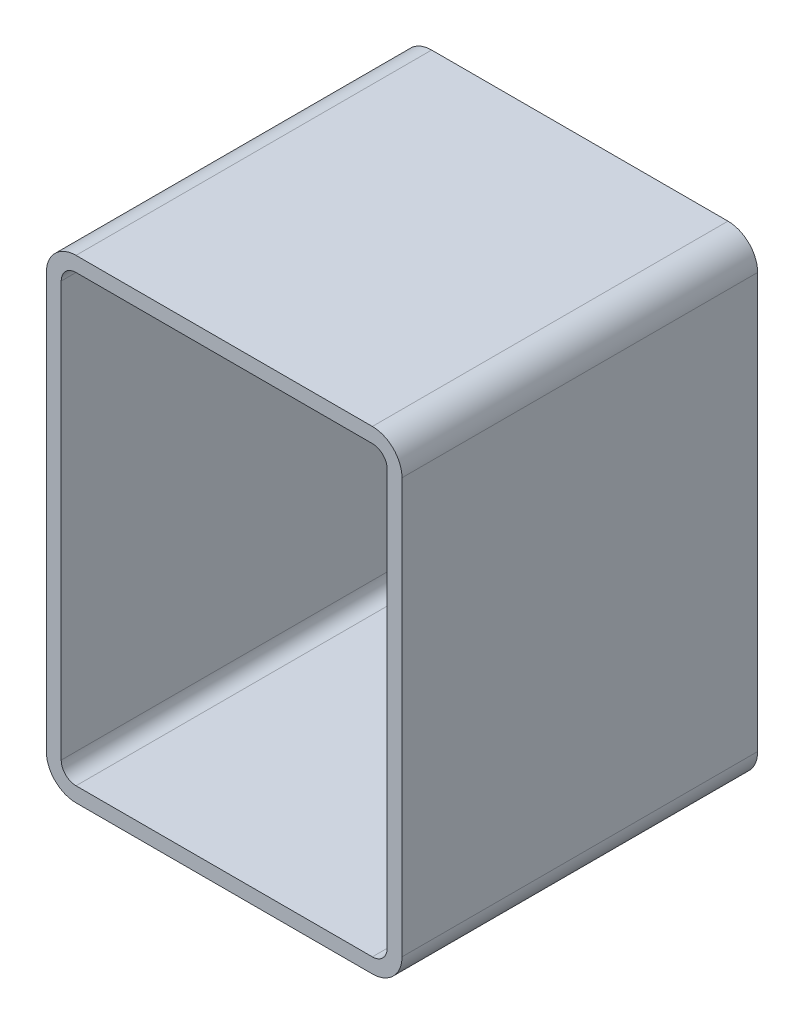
ISO-10303-21;
HEADER;
FILE_DESCRIPTION(('STEP AP214'),'2;1');
FILE_NAME('part.step','',(''),(''),'','','');
FILE_SCHEMA(('AUTOMOTIVE_DESIGN { 1 0 10303 214 1 1 1 1 }'));
ENDSEC;
DATA;
#1=APPLICATION_CONTEXT('core data for automotive mechanical design processes');
#2=APPLICATION_PROTOCOL_DEFINITION('international standard','automotive_design',2000,#1);
#3=PRODUCT_CONTEXT('',#1,'mechanical');
#4=PRODUCT('Part','Part','',(#3));
#5=PRODUCT_RELATED_PRODUCT_CATEGORY('part','',(#4));
#6=PRODUCT_DEFINITION_FORMATION('','',#4);
#7=PRODUCT_DEFINITION_CONTEXT('part definition',#1,'design');
#8=PRODUCT_DEFINITION('design','',#6,#7);
#9=PRODUCT_DEFINITION_SHAPE('','',#8);
#10=(LENGTH_UNIT() NAMED_UNIT(*) SI_UNIT(.MILLI.,.METRE.));
#11=(NAMED_UNIT(*) PLANE_ANGLE_UNIT() SI_UNIT($,.RADIAN.));
#12=(NAMED_UNIT(*) SI_UNIT($,.STERADIAN.) SOLID_ANGLE_UNIT());
#13=UNCERTAINTY_MEASURE_WITH_UNIT(LENGTH_MEASURE(1.E-05),#10,'distance_accuracy_value','');
#14=(GEOMETRIC_REPRESENTATION_CONTEXT(3) GLOBAL_UNCERTAINTY_ASSIGNED_CONTEXT((#13)) GLOBAL_UNIT_ASSIGNED_CONTEXT((#10,
#11,#12)) REPRESENTATION_CONTEXT('',''));
#15=CARTESIAN_POINT('',(0.,0.,0.));
#16=DIRECTION('',(0.,0.,1.));
#17=DIRECTION('',(1.,0.,0.));
#18=AXIS2_PLACEMENT_3D('',#15,#16,#17);
#19=CARTESIAN_POINT('',(26.5067030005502,382.782862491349,304.8));
#20=DIRECTION('',(0.,0.,1.));
#21=DIRECTION('',(1.,0.,0.));
#22=AXIS2_PLACEMENT_3D('',#19,#20,#21);
#23=PLANE('',#22);
#24=CARTESIAN_POINT('',(26.5067030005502,382.782862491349,304.8));
#25=DIRECTION('',(0.,0.,1.));
#26=DIRECTION('',(1.,0.,0.));
#27=AXIS2_PLACEMENT_3D('',#24,#25,#26);
#28=CIRCLE('',#27,25.4);
#29=CARTESIAN_POINT('',(26.5067030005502,408.182862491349,304.8));
#30=VERTEX_POINT('',#29);
#31=CARTESIAN_POINT('',(1.10670300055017,382.782862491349,304.8));
#32=VERTEX_POINT('',#31);
#33=EDGE_CURVE('E211',#30,#32,#28,.T.);
#34=ORIENTED_EDGE('',*,*,#33,.T.);
#35=DIRECTION('',(0.,-1.,0.));
#36=VECTOR('',#35,1.);
#37=CARTESIAN_POINT('',(1.10670300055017,27.1828624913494,304.8));
#38=LINE('',#37,#36);
#39=CARTESIAN_POINT('',(1.10670300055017,27.1828624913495,304.8));
#40=VERTEX_POINT('',#39);
#41=EDGE_CURVE('E214',#32,#40,#38,.T.);
#42=ORIENTED_EDGE('',*,*,#41,.T.);
#43=CARTESIAN_POINT('',(26.5067030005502,27.1828624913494,304.8));
#44=DIRECTION('',(0.,0.,1.));
#45=DIRECTION('',(1.,0.,0.));
#46=AXIS2_PLACEMENT_3D('',#43,#44,#45);
#47=CIRCLE('',#46,25.4);
#48=CARTESIAN_POINT('',(26.5067030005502,1.78286249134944,304.8));
#49=VERTEX_POINT('',#48);
#50=EDGE_CURVE('E217',#40,#49,#47,.T.);
#51=ORIENTED_EDGE('',*,*,#50,.T.);
#52=DIRECTION('',(1.,0.,0.));
#53=VECTOR('',#52,1.);
#54=CARTESIAN_POINT('',(280.50670300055,1.78286249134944,304.8));
#55=LINE('',#54,#53);
#56=CARTESIAN_POINT('',(280.50670300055,1.78286249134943,304.8));
#57=VERTEX_POINT('',#56);
#58=EDGE_CURVE('E219',#49,#57,#55,.T.);
#59=ORIENTED_EDGE('',*,*,#58,.T.);
#60=CARTESIAN_POINT('',(280.50670300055,27.1828624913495,304.8));
#61=DIRECTION('',(0.,0.,1.));
#62=DIRECTION('',(1.,0.,0.));
#63=AXIS2_PLACEMENT_3D('',#60,#61,#62);
#64=CIRCLE('',#63,25.4);
#65=CARTESIAN_POINT('',(305.90670300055,27.1828624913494,304.8));
#66=VERTEX_POINT('',#65);
#67=EDGE_CURVE('E221',#57,#66,#64,.T.);
#68=ORIENTED_EDGE('',*,*,#67,.T.);
#69=DIRECTION('',(0.,1.,0.));
#70=VECTOR('',#69,1.);
#71=CARTESIAN_POINT('',(305.90670300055,382.782862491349,304.8));
#72=LINE('',#71,#70);
#73=CARTESIAN_POINT('',(305.90670300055,382.782862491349,304.8));
#74=VERTEX_POINT('',#73);
#75=EDGE_CURVE('E223',#66,#74,#72,.T.);
#76=ORIENTED_EDGE('',*,*,#75,.T.);
#77=CARTESIAN_POINT('',(280.50670300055,382.782862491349,304.8));
#78=DIRECTION('',(0.,0.,1.));
#79=DIRECTION('',(1.,0.,0.));
#80=AXIS2_PLACEMENT_3D('',#77,#78,#79);
#81=CIRCLE('',#80,25.4);
#82=CARTESIAN_POINT('',(280.50670300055,408.182862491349,304.8));
#83=VERTEX_POINT('',#82);
#84=EDGE_CURVE('E225',#74,#83,#81,.T.);
#85=ORIENTED_EDGE('',*,*,#84,.T.);
#86=DIRECTION('',(-1.,0.,0.));
#87=VECTOR('',#86,1.);
#88=CARTESIAN_POINT('',(26.5067030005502,408.182862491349,304.8));
#89=LINE('',#88,#87);
#90=EDGE_CURVE('E227',#83,#30,#89,.T.);
#91=ORIENTED_EDGE('',*,*,#90,.T.);
#92=EDGE_LOOP('',(#34,#42,#51,#59,#68,#76,#85,#91));
#93=FACE_BOUND('',#92,.T.);
#94=DIRECTION('',(0.,-1.,0.));
#95=VECTOR('',#94,1.);
#96=CARTESIAN_POINT('',(13.8067030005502,27.1828624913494,304.8));
#97=LINE('',#96,#95);
#98=CARTESIAN_POINT('',(13.8067030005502,382.782862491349,304.8));
#99=VERTEX_POINT('',#98);
#100=CARTESIAN_POINT('',(13.8067030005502,27.1828624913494,304.8));
#101=VERTEX_POINT('',#100);
#102=EDGE_CURVE('E154',#99,#101,#97,.T.);
#103=ORIENTED_EDGE('',*,*,#102,.F.);
#104=CARTESIAN_POINT('',(26.5067030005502,382.782862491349,304.8));
#105=DIRECTION('',(0.,0.,1.));
#106=DIRECTION('',(1.,0.,0.));
#107=AXIS2_PLACEMENT_3D('',#104,#105,#106);
#108=CIRCLE('',#107,12.7);
#109=CARTESIAN_POINT('',(26.5067030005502,395.482862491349,304.8));
#110=VERTEX_POINT('',#109);
#111=EDGE_CURVE('E146',#110,#99,#108,.T.);
#112=ORIENTED_EDGE('',*,*,#111,.F.);
#113=DIRECTION('',(-1.,0.,0.));
#114=VECTOR('',#113,1.);
#115=CARTESIAN_POINT('',(26.5067030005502,395.482862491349,304.8));
#116=LINE('',#115,#114);
#117=CARTESIAN_POINT('',(280.50670300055,395.482862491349,304.8));
#118=VERTEX_POINT('',#117);
#119=EDGE_CURVE('E179',#118,#110,#116,.T.);
#120=ORIENTED_EDGE('',*,*,#119,.F.);
#121=CARTESIAN_POINT('',(280.50670300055,382.782862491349,304.8));
#122=DIRECTION('',(0.,0.,1.));
#123=DIRECTION('',(1.,0.,0.));
#124=AXIS2_PLACEMENT_3D('',#121,#122,#123);
#125=CIRCLE('',#124,12.7);
#126=CARTESIAN_POINT('',(293.20670300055,382.782862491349,304.8));
#127=VERTEX_POINT('',#126);
#128=EDGE_CURVE('E177',#127,#118,#125,.T.);
#129=ORIENTED_EDGE('',*,*,#128,.F.);
#130=DIRECTION('',(0.,1.,0.));
#131=VECTOR('',#130,1.);
#132=CARTESIAN_POINT('',(293.20670300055,382.782862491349,304.8));
#133=LINE('',#132,#131);
#134=CARTESIAN_POINT('',(293.20670300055,27.1828624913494,304.8));
#135=VERTEX_POINT('',#134);
#136=EDGE_CURVE('E175',#135,#127,#133,.T.);
#137=ORIENTED_EDGE('',*,*,#136,.F.);
#138=CARTESIAN_POINT('',(280.50670300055,27.1828624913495,304.8));
#139=DIRECTION('',(0.,0.,1.));
#140=DIRECTION('',(1.,0.,0.));
#141=AXIS2_PLACEMENT_3D('',#138,#139,#140);
#142=CIRCLE('',#141,12.7);
#143=CARTESIAN_POINT('',(280.50670300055,14.4828624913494,304.8));
#144=VERTEX_POINT('',#143);
#145=EDGE_CURVE('E173',#144,#135,#142,.T.);
#146=ORIENTED_EDGE('',*,*,#145,.F.);
#147=DIRECTION('',(1.,0.,0.));
#148=VECTOR('',#147,1.);
#149=CARTESIAN_POINT('',(280.50670300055,14.4828624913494,304.8));
#150=LINE('',#149,#148);
#151=CARTESIAN_POINT('',(26.5067030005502,14.4828624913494,304.8));
#152=VERTEX_POINT('',#151);
#153=EDGE_CURVE('E169',#152,#144,#150,.T.);
#154=ORIENTED_EDGE('',*,*,#153,.F.);
#155=CARTESIAN_POINT('',(26.5067030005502,27.1828624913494,304.8));
#156=DIRECTION('',(0.,0.,1.));
#157=DIRECTION('',(1.,0.,0.));
#158=AXIS2_PLACEMENT_3D('',#155,#156,#157);
#159=CIRCLE('',#158,12.7);
#160=EDGE_CURVE('E167',#101,#152,#159,.T.);
#161=ORIENTED_EDGE('',*,*,#160,.F.);
#162=EDGE_LOOP('',(#103,#112,#120,#129,#137,#146,#154,#161));
#163=FACE_BOUND('',#162,.T.);
#164=ADVANCED_FACE('F33',(#93,#163),#23,.T.);
#165=CARTESIAN_POINT('',(26.5067030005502,382.782862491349,0.));
#166=DIRECTION('',(0.,0.,1.));
#167=DIRECTION('',(1.,0.,0.));
#168=AXIS2_PLACEMENT_3D('',#165,#166,#167);
#169=PLANE('',#168);
#170=CARTESIAN_POINT('',(26.5067030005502,382.782862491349,0.));
#171=DIRECTION('',(0.,0.,1.));
#172=DIRECTION('',(1.,0.,0.));
#173=AXIS2_PLACEMENT_3D('',#170,#171,#172);
#174=CIRCLE('',#173,25.4);
#175=CARTESIAN_POINT('',(26.5067030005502,408.182862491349,0.));
#176=VERTEX_POINT('',#175);
#177=CARTESIAN_POINT('',(1.10670300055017,382.782862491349,0.));
#178=VERTEX_POINT('',#177);
#179=EDGE_CURVE('E162',#176,#178,#174,.T.);
#180=ORIENTED_EDGE('',*,*,#179,.F.);
#181=DIRECTION('',(-1.,0.,0.));
#182=VECTOR('',#181,1.);
#183=CARTESIAN_POINT('',(26.5067030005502,408.182862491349,0.));
#184=LINE('',#183,#182);
#185=CARTESIAN_POINT('',(280.50670300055,408.182862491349,0.));
#186=VERTEX_POINT('',#185);
#187=EDGE_CURVE('E215',#186,#176,#184,.T.);
#188=ORIENTED_EDGE('',*,*,#187,.F.);
#189=CARTESIAN_POINT('',(280.50670300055,382.782862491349,0.));
#190=DIRECTION('',(0.,0.,1.));
#191=DIRECTION('',(1.,0.,0.));
#192=AXIS2_PLACEMENT_3D('',#189,#190,#191);
#193=CIRCLE('',#192,25.4);
#194=CARTESIAN_POINT('',(305.90670300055,382.782862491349,0.));
#195=VERTEX_POINT('',#194);
#196=EDGE_CURVE('E242',#195,#186,#193,.T.);
#197=ORIENTED_EDGE('',*,*,#196,.F.);
#198=DIRECTION('',(0.,1.,0.));
#199=VECTOR('',#198,1.);
#200=CARTESIAN_POINT('',(305.90670300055,382.782862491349,0.));
#201=LINE('',#200,#199);
#202=CARTESIAN_POINT('',(305.90670300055,27.1828624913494,0.));
#203=VERTEX_POINT('',#202);
#204=EDGE_CURVE('E240',#203,#195,#201,.T.);
#205=ORIENTED_EDGE('',*,*,#204,.F.);
#206=CARTESIAN_POINT('',(280.50670300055,27.1828624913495,0.));
#207=DIRECTION('',(0.,0.,1.));
#208=DIRECTION('',(1.,0.,0.));
#209=AXIS2_PLACEMENT_3D('',#206,#207,#208);
#210=CIRCLE('',#209,25.4);
#211=CARTESIAN_POINT('',(280.50670300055,1.78286249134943,0.));
#212=VERTEX_POINT('',#211);
#213=EDGE_CURVE('E238',#212,#203,#210,.T.);
#214=ORIENTED_EDGE('',*,*,#213,.F.);
#215=DIRECTION('',(1.,0.,0.));
#216=VECTOR('',#215,1.);
#217=CARTESIAN_POINT('',(280.50670300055,1.78286249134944,0.));
#218=LINE('',#217,#216);
#219=CARTESIAN_POINT('',(26.5067030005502,1.78286249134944,0.));
#220=VERTEX_POINT('',#219);
#221=EDGE_CURVE('E236',#220,#212,#218,.T.);
#222=ORIENTED_EDGE('',*,*,#221,.F.);
#223=CARTESIAN_POINT('',(26.5067030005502,27.1828624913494,0.));
#224=DIRECTION('',(0.,0.,1.));
#225=DIRECTION('',(1.,0.,0.));
#226=AXIS2_PLACEMENT_3D('',#223,#224,#225);
#227=CIRCLE('',#226,25.4);
#228=CARTESIAN_POINT('',(1.10670300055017,27.1828624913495,0.));
#229=VERTEX_POINT('',#228);
#230=EDGE_CURVE('E234',#229,#220,#227,.T.);
#231=ORIENTED_EDGE('',*,*,#230,.F.);
#232=DIRECTION('',(0.,-1.,0.));
#233=VECTOR('',#232,1.);
#234=CARTESIAN_POINT('',(1.10670300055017,27.1828624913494,0.));
#235=LINE('',#234,#233);
#236=EDGE_CURVE('E232',#178,#229,#235,.T.);
#237=ORIENTED_EDGE('',*,*,#236,.F.);
#238=EDGE_LOOP('',(#180,#188,#197,#205,#214,#222,#231,#237));
#239=FACE_BOUND('',#238,.T.);
#240=CARTESIAN_POINT('',(26.5067030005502,382.782862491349,0.));
#241=DIRECTION('',(0.,0.,1.));
#242=DIRECTION('',(1.,0.,0.));
#243=AXIS2_PLACEMENT_3D('',#240,#241,#242);
#244=CIRCLE('',#243,12.7);
#245=CARTESIAN_POINT('',(26.5067030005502,395.482862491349,0.));
#246=VERTEX_POINT('',#245);
#247=CARTESIAN_POINT('',(13.8067030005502,382.782862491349,0.));
#248=VERTEX_POINT('',#247);
#249=EDGE_CURVE('E56',#246,#248,#244,.T.);
#250=ORIENTED_EDGE('',*,*,#249,.T.);
#251=DIRECTION('',(0.,-1.,0.));
#252=VECTOR('',#251,1.);
#253=CARTESIAN_POINT('',(13.8067030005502,27.1828624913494,0.));
#254=LINE('',#253,#252);
#255=CARTESIAN_POINT('',(13.8067030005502,27.1828624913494,0.));
#256=VERTEX_POINT('',#255);
#257=EDGE_CURVE('E161',#248,#256,#254,.T.);
#258=ORIENTED_EDGE('',*,*,#257,.T.);
#259=CARTESIAN_POINT('',(26.5067030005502,27.1828624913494,0.));
#260=DIRECTION('',(0.,0.,1.));
#261=DIRECTION('',(1.,0.,0.));
#262=AXIS2_PLACEMENT_3D('',#259,#260,#261);
#263=CIRCLE('',#262,12.7);
#264=CARTESIAN_POINT('',(26.5067030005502,14.4828624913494,0.));
#265=VERTEX_POINT('',#264);
#266=EDGE_CURVE('E183',#256,#265,#263,.T.);
#267=ORIENTED_EDGE('',*,*,#266,.T.);
#268=DIRECTION('',(1.,0.,0.));
#269=VECTOR('',#268,1.);
#270=CARTESIAN_POINT('',(280.50670300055,14.4828624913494,0.));
#271=LINE('',#270,#269);
#272=CARTESIAN_POINT('',(280.50670300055,14.4828624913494,0.));
#273=VERTEX_POINT('',#272);
#274=EDGE_CURVE('E186',#265,#273,#271,.T.);
#275=ORIENTED_EDGE('',*,*,#274,.T.);
#276=CARTESIAN_POINT('',(280.50670300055,27.1828624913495,0.));
#277=DIRECTION('',(0.,0.,1.));
#278=DIRECTION('',(1.,0.,0.));
#279=AXIS2_PLACEMENT_3D('',#276,#277,#278);
#280=CIRCLE('',#279,12.7);
#281=CARTESIAN_POINT('',(293.20670300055,27.1828624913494,0.));
#282=VERTEX_POINT('',#281);
#283=EDGE_CURVE('E189',#273,#282,#280,.T.);
#284=ORIENTED_EDGE('',*,*,#283,.T.);
#285=DIRECTION('',(0.,1.,0.));
#286=VECTOR('',#285,1.);
#287=CARTESIAN_POINT('',(293.20670300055,382.782862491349,0.));
#288=LINE('',#287,#286);
#289=CARTESIAN_POINT('',(293.20670300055,382.782862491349,0.));
#290=VERTEX_POINT('',#289);
#291=EDGE_CURVE('E192',#282,#290,#288,.T.);
#292=ORIENTED_EDGE('',*,*,#291,.T.);
#293=CARTESIAN_POINT('',(280.50670300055,382.782862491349,0.));
#294=DIRECTION('',(0.,0.,1.));
#295=DIRECTION('',(1.,0.,0.));
#296=AXIS2_PLACEMENT_3D('',#293,#294,#295);
#297=CIRCLE('',#296,12.7);
#298=CARTESIAN_POINT('',(280.50670300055,395.482862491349,0.));
#299=VERTEX_POINT('',#298);
#300=EDGE_CURVE('E195',#290,#299,#297,.T.);
#301=ORIENTED_EDGE('',*,*,#300,.T.);
#302=DIRECTION('',(-1.,0.,0.));
#303=VECTOR('',#302,1.);
#304=CARTESIAN_POINT('',(26.5067030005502,395.482862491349,0.));
#305=LINE('',#304,#303);
#306=EDGE_CURVE('E155',#299,#246,#305,.T.);
#307=ORIENTED_EDGE('',*,*,#306,.T.);
#308=EDGE_LOOP('',(#250,#258,#267,#275,#284,#292,#301,#307));
#309=FACE_BOUND('',#308,.T.);
#310=ADVANCED_FACE('F272',(#239,#309),#169,.F.);
#311=CARTESIAN_POINT('',(26.5067030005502,382.782862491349,304.8));
#312=DIRECTION('',(0.,0.,-1.));
#313=DIRECTION('',(-1.,0.,0.));
#314=AXIS2_PLACEMENT_3D('',#311,#312,#313);
#315=CYLINDRICAL_SURFACE('',#314,25.4);
#316=ORIENTED_EDGE('',*,*,#179,.T.);
#317=DIRECTION('',(0.,0.,-1.));
#318=VECTOR('',#317,1.);
#319=CARTESIAN_POINT('',(1.10670300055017,382.782862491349,304.8));
#320=LINE('',#319,#318);
#321=EDGE_CURVE('E11',#32,#178,#320,.T.);
#322=ORIENTED_EDGE('',*,*,#321,.F.);
#323=ORIENTED_EDGE('',*,*,#33,.F.);
#324=DIRECTION('',(0.,0.,-1.));
#325=VECTOR('',#324,1.);
#326=CARTESIAN_POINT('',(26.5067030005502,408.182862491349,304.8));
#327=LINE('',#326,#325);
#328=EDGE_CURVE('E229',#30,#176,#327,.T.);
#329=ORIENTED_EDGE('',*,*,#328,.T.);
#330=EDGE_LOOP('',(#316,#322,#323,#329));
#331=FACE_BOUND('',#330,.T.);
#332=ADVANCED_FACE('F35',(#331),#315,.T.);
#333=CARTESIAN_POINT('',(1.10670300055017,27.1828624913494,304.8));
#334=DIRECTION('',(1.,0.,0.));
#335=DIRECTION('',(0.,0.,-1.));
#336=AXIS2_PLACEMENT_3D('',#333,#334,#335);
#337=PLANE('',#336);
#338=ORIENTED_EDGE('',*,*,#236,.T.);
#339=DIRECTION('',(0.,0.,-1.));
#340=VECTOR('',#339,1.);
#341=CARTESIAN_POINT('',(1.10670300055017,27.1828624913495,304.8));
#342=LINE('',#341,#340);
#343=EDGE_CURVE('E41',#40,#229,#342,.T.);
#344=ORIENTED_EDGE('',*,*,#343,.F.);
#345=ORIENTED_EDGE('',*,*,#41,.F.);
#346=ORIENTED_EDGE('',*,*,#321,.T.);
#347=EDGE_LOOP('',(#338,#344,#345,#346));
#348=FACE_BOUND('',#347,.T.);
#349=ADVANCED_FACE('F289',(#348),#337,.F.);
#350=CARTESIAN_POINT('',(26.5067030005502,27.1828624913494,304.8));
#351=DIRECTION('',(0.,0.,-1.));
#352=DIRECTION('',(-1.,0.,0.));
#353=AXIS2_PLACEMENT_3D('',#350,#351,#352);
#354=CYLINDRICAL_SURFACE('',#353,25.4);
#355=ORIENTED_EDGE('',*,*,#230,.T.);
#356=DIRECTION('',(0.,0.,-1.));
#357=VECTOR('',#356,1.);
#358=CARTESIAN_POINT('',(26.5067030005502,1.78286249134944,304.8));
#359=LINE('',#358,#357);
#360=EDGE_CURVE('E259',#49,#220,#359,.T.);
#361=ORIENTED_EDGE('',*,*,#360,.F.);
#362=ORIENTED_EDGE('',*,*,#50,.F.);
#363=ORIENTED_EDGE('',*,*,#343,.T.);
#364=EDGE_LOOP('',(#355,#361,#362,#363));
#365=FACE_BOUND('',#364,.T.);
#366=ADVANCED_FACE('F266',(#365),#354,.T.);
#367=CARTESIAN_POINT('',(280.50670300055,1.78286249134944,304.8));
#368=DIRECTION('',(0.,1.,0.));
#369=DIRECTION('',(0.,0.,1.));
#370=AXIS2_PLACEMENT_3D('',#367,#368,#369);
#371=PLANE('',#370);
#372=ORIENTED_EDGE('',*,*,#221,.T.);
#373=DIRECTION('',(0.,0.,-1.));
#374=VECTOR('',#373,1.);
#375=CARTESIAN_POINT('',(280.50670300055,1.78286249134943,304.8));
#376=LINE('',#375,#374);
#377=EDGE_CURVE('E256',#57,#212,#376,.T.);
#378=ORIENTED_EDGE('',*,*,#377,.F.);
#379=ORIENTED_EDGE('',*,*,#58,.F.);
#380=ORIENTED_EDGE('',*,*,#360,.T.);
#381=EDGE_LOOP('',(#372,#378,#379,#380));
#382=FACE_BOUND('',#381,.T.);
#383=ADVANCED_FACE('F278',(#382),#371,.F.);
#384=CARTESIAN_POINT('',(280.50670300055,27.1828624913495,304.8));
#385=DIRECTION('',(0.,0.,-1.));
#386=DIRECTION('',(-1.,0.,0.));
#387=AXIS2_PLACEMENT_3D('',#384,#385,#386);
#388=CYLINDRICAL_SURFACE('',#387,25.4);
#389=ORIENTED_EDGE('',*,*,#213,.T.);
#390=DIRECTION('',(0.,0.,-1.));
#391=VECTOR('',#390,1.);
#392=CARTESIAN_POINT('',(305.90670300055,27.1828624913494,304.8));
#393=LINE('',#392,#391);
#394=EDGE_CURVE('E253',#66,#203,#393,.T.);
#395=ORIENTED_EDGE('',*,*,#394,.F.);
#396=ORIENTED_EDGE('',*,*,#67,.F.);
#397=ORIENTED_EDGE('',*,*,#377,.T.);
#398=EDGE_LOOP('',(#389,#395,#396,#397));
#399=FACE_BOUND('',#398,.T.);
#400=ADVANCED_FACE('F282',(#399),#388,.T.);
#401=CARTESIAN_POINT('',(305.90670300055,382.782862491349,304.8));
#402=DIRECTION('',(-1.,0.,0.));
#403=DIRECTION('',(0.,0.,1.));
#404=AXIS2_PLACEMENT_3D('',#401,#402,#403);
#405=PLANE('',#404);
#406=ORIENTED_EDGE('',*,*,#204,.T.);
#407=DIRECTION('',(0.,0.,-1.));
#408=VECTOR('',#407,1.);
#409=CARTESIAN_POINT('',(305.90670300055,382.782862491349,304.8));
#410=LINE('',#409,#408);
#411=EDGE_CURVE('E250',#74,#195,#410,.T.);
#412=ORIENTED_EDGE('',*,*,#411,.F.);
#413=ORIENTED_EDGE('',*,*,#75,.F.);
#414=ORIENTED_EDGE('',*,*,#394,.T.);
#415=EDGE_LOOP('',(#406,#412,#413,#414));
#416=FACE_BOUND('',#415,.T.);
#417=ADVANCED_FACE('F302',(#416),#405,.F.);
#418=CARTESIAN_POINT('',(280.50670300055,382.782862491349,304.8));
#419=DIRECTION('',(0.,0.,-1.));
#420=DIRECTION('',(-1.,0.,0.));
#421=AXIS2_PLACEMENT_3D('',#418,#419,#420);
#422=CYLINDRICAL_SURFACE('',#421,25.4);
#423=ORIENTED_EDGE('',*,*,#196,.T.);
#424=DIRECTION('',(0.,0.,-1.));
#425=VECTOR('',#424,1.);
#426=CARTESIAN_POINT('',(280.50670300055,408.182862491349,304.8));
#427=LINE('',#426,#425);
#428=EDGE_CURVE('E247',#83,#186,#427,.T.);
#429=ORIENTED_EDGE('',*,*,#428,.F.);
#430=ORIENTED_EDGE('',*,*,#84,.F.);
#431=ORIENTED_EDGE('',*,*,#411,.T.);
#432=EDGE_LOOP('',(#423,#429,#430,#431));
#433=FACE_BOUND('',#432,.T.);
#434=ADVANCED_FACE('F300',(#433),#422,.T.);
#435=CARTESIAN_POINT('',(26.5067030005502,408.182862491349,304.8));
#436=DIRECTION('',(0.,-1.,0.));
#437=DIRECTION('',(0.,0.,-1.));
#438=AXIS2_PLACEMENT_3D('',#435,#436,#437);
#439=PLANE('',#438);
#440=ORIENTED_EDGE('',*,*,#187,.T.);
#441=ORIENTED_EDGE('',*,*,#328,.F.);
#442=ORIENTED_EDGE('',*,*,#90,.F.);
#443=ORIENTED_EDGE('',*,*,#428,.T.);
#444=EDGE_LOOP('',(#440,#441,#442,#443));
#445=FACE_BOUND('',#444,.T.);
#446=ADVANCED_FACE('F295',(#445),#439,.F.);
#447=CARTESIAN_POINT('',(26.5067030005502,382.782862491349,304.8));
#448=DIRECTION('',(0.,0.,-1.));
#449=DIRECTION('',(-1.,0.,0.));
#450=AXIS2_PLACEMENT_3D('',#447,#448,#449);
#451=CYLINDRICAL_SURFACE('',#450,12.7);
#452=ORIENTED_EDGE('',*,*,#249,.F.);
#453=DIRECTION('',(0.,0.,-1.));
#454=VECTOR('',#453,1.);
#455=CARTESIAN_POINT('',(26.5067030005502,395.482862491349,304.8));
#456=LINE('',#455,#454);
#457=EDGE_CURVE('E150',#110,#246,#456,.T.);
#458=ORIENTED_EDGE('',*,*,#457,.F.);
#459=ORIENTED_EDGE('',*,*,#111,.T.);
#460=DIRECTION('',(0.,0.,-1.));
#461=VECTOR('',#460,1.);
#462=CARTESIAN_POINT('',(13.8067030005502,382.782862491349,304.8));
#463=LINE('',#462,#461);
#464=EDGE_CURVE('E149',#99,#248,#463,.T.);
#465=ORIENTED_EDGE('',*,*,#464,.T.);
#466=EDGE_LOOP('',(#452,#458,#459,#465));
#467=FACE_BOUND('',#466,.T.);
#468=ADVANCED_FACE('F148',(#467),#451,.F.);
#469=CARTESIAN_POINT('',(13.8067030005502,27.1828624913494,304.8));
#470=DIRECTION('',(1.,0.,0.));
#471=DIRECTION('',(0.,0.,-1.));
#472=AXIS2_PLACEMENT_3D('',#469,#470,#471);
#473=PLANE('',#472);
#474=ORIENTED_EDGE('',*,*,#257,.F.);
#475=ORIENTED_EDGE('',*,*,#464,.F.);
#476=ORIENTED_EDGE('',*,*,#102,.T.);
#477=DIRECTION('',(0.,0.,-1.));
#478=VECTOR('',#477,1.);
#479=CARTESIAN_POINT('',(13.8067030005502,27.1828624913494,304.8));
#480=LINE('',#479,#478);
#481=EDGE_CURVE('E163',#101,#256,#480,.T.);
#482=ORIENTED_EDGE('',*,*,#481,.T.);
#483=EDGE_LOOP('',(#474,#475,#476,#482));
#484=FACE_BOUND('',#483,.T.);
#485=ADVANCED_FACE('F158',(#484),#473,.T.);
#486=CARTESIAN_POINT('',(26.5067030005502,27.1828624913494,304.8));
#487=DIRECTION('',(0.,0.,-1.));
#488=DIRECTION('',(-1.,0.,0.));
#489=AXIS2_PLACEMENT_3D('',#486,#487,#488);
#490=CYLINDRICAL_SURFACE('',#489,12.7);
#491=ORIENTED_EDGE('',*,*,#266,.F.);
#492=ORIENTED_EDGE('',*,*,#481,.F.);
#493=ORIENTED_EDGE('',*,*,#160,.T.);
#494=DIRECTION('',(0.,0.,-1.));
#495=VECTOR('',#494,1.);
#496=CARTESIAN_POINT('',(26.5067030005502,14.4828624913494,304.8));
#497=LINE('',#496,#495);
#498=EDGE_CURVE('E208',#152,#265,#497,.T.);
#499=ORIENTED_EDGE('',*,*,#498,.T.);
#500=EDGE_LOOP('',(#491,#492,#493,#499));
#501=FACE_BOUND('',#500,.T.);
#502=ADVANCED_FACE('F327',(#501),#490,.F.);
#503=CARTESIAN_POINT('',(280.50670300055,14.4828624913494,304.8));
#504=DIRECTION('',(0.,1.,0.));
#505=DIRECTION('',(0.,0.,1.));
#506=AXIS2_PLACEMENT_3D('',#503,#504,#505);
#507=PLANE('',#506);
#508=ORIENTED_EDGE('',*,*,#274,.F.);
#509=ORIENTED_EDGE('',*,*,#498,.F.);
#510=ORIENTED_EDGE('',*,*,#153,.T.);
#511=DIRECTION('',(0.,0.,-1.));
#512=VECTOR('',#511,1.);
#513=CARTESIAN_POINT('',(280.50670300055,14.4828624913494,304.8));
#514=LINE('',#513,#512);
#515=EDGE_CURVE('E206',#144,#273,#514,.T.);
#516=ORIENTED_EDGE('',*,*,#515,.T.);
#517=EDGE_LOOP('',(#508,#509,#510,#516));
#518=FACE_BOUND('',#517,.T.);
#519=ADVANCED_FACE('F331',(#518),#507,.T.);
#520=CARTESIAN_POINT('',(280.50670300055,27.1828624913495,304.8));
#521=DIRECTION('',(0.,0.,-1.));
#522=DIRECTION('',(-1.,0.,0.));
#523=AXIS2_PLACEMENT_3D('',#520,#521,#522);
#524=CYLINDRICAL_SURFACE('',#523,12.7);
#525=ORIENTED_EDGE('',*,*,#283,.F.);
#526=ORIENTED_EDGE('',*,*,#515,.F.);
#527=ORIENTED_EDGE('',*,*,#145,.T.);
#528=DIRECTION('',(0.,0.,-1.));
#529=VECTOR('',#528,1.);
#530=CARTESIAN_POINT('',(293.20670300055,27.1828624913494,304.8));
#531=LINE('',#530,#529);
#532=EDGE_CURVE('E204',#135,#282,#531,.T.);
#533=ORIENTED_EDGE('',*,*,#532,.T.);
#534=EDGE_LOOP('',(#525,#526,#527,#533));
#535=FACE_BOUND('',#534,.T.);
#536=ADVANCED_FACE('F337',(#535),#524,.F.);
#537=CARTESIAN_POINT('',(293.20670300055,382.782862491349,304.8));
#538=DIRECTION('',(-1.,0.,0.));
#539=DIRECTION('',(0.,0.,1.));
#540=AXIS2_PLACEMENT_3D('',#537,#538,#539);
#541=PLANE('',#540);
#542=ORIENTED_EDGE('',*,*,#291,.F.);
#543=ORIENTED_EDGE('',*,*,#532,.F.);
#544=ORIENTED_EDGE('',*,*,#136,.T.);
#545=DIRECTION('',(0.,0.,-1.));
#546=VECTOR('',#545,1.);
#547=CARTESIAN_POINT('',(293.20670300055,382.782862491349,304.8));
#548=LINE('',#547,#546);
#549=EDGE_CURVE('E202',#127,#290,#548,.T.);
#550=ORIENTED_EDGE('',*,*,#549,.T.);
#551=EDGE_LOOP('',(#542,#543,#544,#550));
#552=FACE_BOUND('',#551,.T.);
#553=ADVANCED_FACE('F341',(#552),#541,.T.);
#554=CARTESIAN_POINT('',(280.50670300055,382.782862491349,304.8));
#555=DIRECTION('',(0.,0.,-1.));
#556=DIRECTION('',(-1.,0.,0.));
#557=AXIS2_PLACEMENT_3D('',#554,#555,#556);
#558=CYLINDRICAL_SURFACE('',#557,12.7);
#559=ORIENTED_EDGE('',*,*,#300,.F.);
#560=ORIENTED_EDGE('',*,*,#549,.F.);
#561=ORIENTED_EDGE('',*,*,#128,.T.);
#562=DIRECTION('',(0.,0.,-1.));
#563=VECTOR('',#562,1.);
#564=CARTESIAN_POINT('',(280.50670300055,395.482862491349,304.8));
#565=LINE('',#564,#563);
#566=EDGE_CURVE('E48',#118,#299,#565,.T.);
#567=ORIENTED_EDGE('',*,*,#566,.T.);
#568=EDGE_LOOP('',(#559,#560,#561,#567));
#569=FACE_BOUND('',#568,.T.);
#570=ADVANCED_FACE('F345',(#569),#558,.F.);
#571=CARTESIAN_POINT('',(26.5067030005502,395.482862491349,304.8));
#572=DIRECTION('',(0.,-1.,0.));
#573=DIRECTION('',(0.,0.,-1.));
#574=AXIS2_PLACEMENT_3D('',#571,#572,#573);
#575=PLANE('',#574);
#576=ORIENTED_EDGE('',*,*,#306,.F.);
#577=ORIENTED_EDGE('',*,*,#566,.F.);
#578=ORIENTED_EDGE('',*,*,#119,.T.);
#579=ORIENTED_EDGE('',*,*,#457,.T.);
#580=EDGE_LOOP('',(#576,#577,#578,#579));
#581=FACE_BOUND('',#580,.T.);
#582=ADVANCED_FACE('F349',(#581),#575,.T.);
#583=CLOSED_SHELL('',(#164,#310,#332,#349,#366,#383,#400,#417,#434,#446,#468,#485,#502,#519,
#536,#553,#570,#582));
#584=MANIFOLD_SOLID_BREP('B2',#583);
#585=ADVANCED_BREP_SHAPE_REPRESENTATION('',(#18,#584),#14);
#586=SHAPE_DEFINITION_REPRESENTATION(#9,#585);
ENDSEC;
END-ISO-10303-21;
